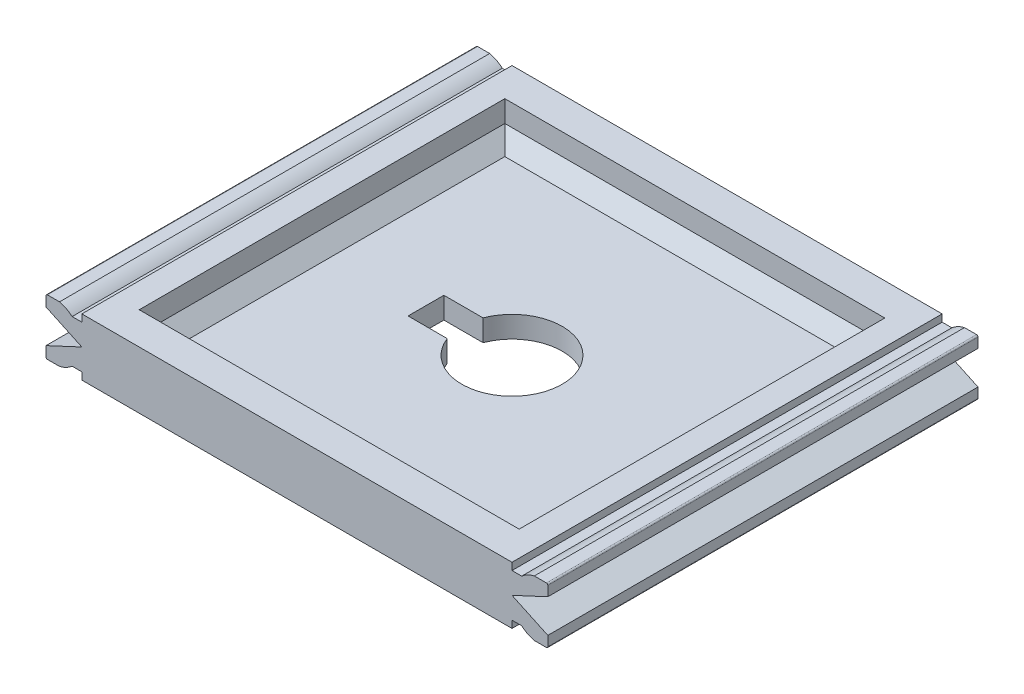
from build123d import *

# Parameters (mm, degrees)
EXTRUDE_1_DEPTH       = 2
EXTRUDE_1_DEPTH_BACK  = 2
SKETCH_1_W            = 30
SKETCH_1_H            = 30
SKETCH_2_W            = 26.5
SKETCH_2_H            = 25.5
CUT_EXTRUDE_1_DEPTH   = 2.5
CHAMFER_1_SIZE        = 1
EXTRUDE_2_DEPTH       = 15
MIRROR_2_COPY_1_DEPTH = 15
FILLET_1_R            = 0.1
CUT_EXTRUDE_2_REACH   = 25.184


with BuildPart() as part:
    # Sketch 1 → Extrude 1 (new, two sides: drawn at the far end of the back side and taken through both)
    with BuildSketch(Plane(origin=(0, 0, 0), x_dir=(1, 0, 0), z_dir=(0, 1, 0)).offset(-EXTRUDE_1_DEPTH_BACK)):
        Rectangle(SKETCH_1_W, SKETCH_1_H)
    extrude(amount=EXTRUDE_1_DEPTH + EXTRUDE_1_DEPTH_BACK)

    # Sketch 2 → Cut-Extrude 1 (cut)
    with BuildSketch(Plane(origin=(0, 2, 0), x_dir=(1, 0, 0), z_dir=(0, 1, 0))):
        Rectangle(SKETCH_2_W, SKETCH_2_H)
    extrude(amount=-CUT_EXTRUDE_1_DEPTH, mode=Mode.SUBTRACT)

    # Chamfer 1
    chamfer_1_edges = [part.edges().sort_by_distance(p)[0] for p in [
        (0, -0.5, -12.75),
        (13.25, -0.5, 0),
        (0, -0.5, 12.75),
        (-13.25, -0.5, 0),
    ]]
    chamfer(chamfer_1_edges, length=CHAMFER_1_SIZE)

    # Sketch 3 → Extrude 2 (add, symmetric)
    with BuildSketch(Plane.XY):
        with BuildLine():
            Line((15.677124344, 1.5), (15, 1.5))
            Line((15, 1.5), (15, 0))
            Line((15, 0), (17.5, 1.165769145))
            Line((17.5, 1.165769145), (17.5, 1.95))
            Line((17.5, 1.95), (16.555590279, 1.95))
            ThreePointArc((16.555590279, 1.95), (16.088161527, 1.780042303), (15.677124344, 1.5))
        make_face()
    extrude_2 = extrude(amount=EXTRUDE_2_DEPTH, both=True)

    # Mirror 1: Extrude 2 across plane
    add(extrude_2.mirror(Plane.ZX))

    # Mirror 2: Extrude 2 across plane
    add(extrude_2.mirror(Plane(origin=(0, 0, 0), x_dir=(0, 0, 1), z_dir=(1, 0, 0))))

    # Mirror 2 copy 1 sketch → Mirror 2 copy 1 (add, symmetric)
    with BuildSketch(Plane(origin=(0, 0, 0), x_dir=(-1, 0, 0), z_dir=(0, 0, 1))):
        with BuildLine():
            Line((15.677124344, 1.5), (15, 1.5))
            Line((15, 1.5), (15, 0))
            Line((15, 0), (17.5, 1.165769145))
            Line((17.5, 1.165769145), (17.5, 1.95))
            Line((17.5, 1.95), (16.555590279, 1.95))
            ThreePointArc((16.555590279, 1.95), (16.088161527, 1.780042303), (15.677124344, 1.5))
        make_face()
    extrude(amount=MIRROR_2_COPY_1_DEPTH, both=True)

    # Fillet 1
    fillet_1_edges = [part.edges().sort_by_distance(p)[0] for p in [
        (-17.5, -1.95, 0),
        (17.5, 1.95, 0),
        (17.5, -1.95, 0),
        (-17.5, 1.95, 0),
    ]]
    fillet(fillet_1_edges, radius=FILLET_1_R)

    # Sketch 4 → Cut-Extrude 2 (cut, up to next)
    with BuildSketch(Plane(origin=(0, -0.5, 0), x_dir=(1, 0, 0), z_dir=(0, 1, 0)), mode=Mode.PRIVATE) as cut_extrude_2_sk1:
        with BuildLine():
            Line((-3.269174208, 1.25), (-6, 1.25))
            Line((-6, 1.25), (-6, -1.25))
            Line((-6, -1.25), (-3.269174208, -1.25))
            ThreePointArc((-3.269174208, -1.25), (3.5, 0), (-3.269174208, 1.25))
        make_face()
    cut_extrude_2_tool1 = extrude(cut_extrude_2_sk1.sketch, amount=-CUT_EXTRUDE_2_REACH, mode=Mode.PRIVATE) & part.part
    add(cut_extrude_2_tool1.solids().sort_by_distance((-0.675327, -0.5, 0))[0], mode=Mode.SUBTRACT)


solid = part.part
